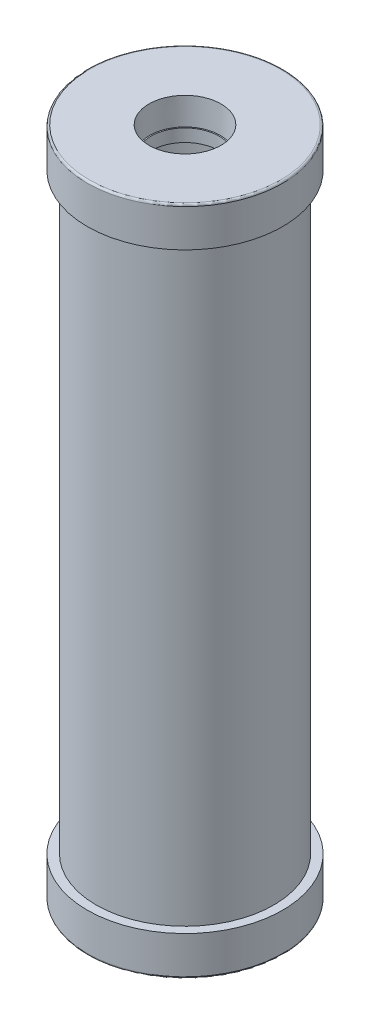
ISO-10303-21;
HEADER;
FILE_DESCRIPTION(('STEP AP214'),'2;1');
FILE_NAME('part.step','',(''),(''),'','','');
FILE_SCHEMA(('AUTOMOTIVE_DESIGN { 1 0 10303 214 1 1 1 1 }'));
ENDSEC;
DATA;
#1=APPLICATION_CONTEXT('core data for automotive mechanical design processes');
#2=APPLICATION_PROTOCOL_DEFINITION('international standard','automotive_design',2000,#1);
#3=PRODUCT_CONTEXT('',#1,'mechanical');
#4=PRODUCT('Part','Part','',(#3));
#5=PRODUCT_RELATED_PRODUCT_CATEGORY('part','',(#4));
#6=PRODUCT_DEFINITION_FORMATION('','',#4);
#7=PRODUCT_DEFINITION_CONTEXT('part definition',#1,'design');
#8=PRODUCT_DEFINITION('design','',#6,#7);
#9=PRODUCT_DEFINITION_SHAPE('','',#8);
#10=(LENGTH_UNIT() NAMED_UNIT(*) SI_UNIT(.MILLI.,.METRE.));
#11=(NAMED_UNIT(*) PLANE_ANGLE_UNIT() SI_UNIT($,.RADIAN.));
#12=(NAMED_UNIT(*) SI_UNIT($,.STERADIAN.) SOLID_ANGLE_UNIT());
#13=UNCERTAINTY_MEASURE_WITH_UNIT(LENGTH_MEASURE(1.E-05),#10,'distance_accuracy_value','');
#14=(GEOMETRIC_REPRESENTATION_CONTEXT(3) GLOBAL_UNCERTAINTY_ASSIGNED_CONTEXT((#13)) GLOBAL_UNIT_ASSIGNED_CONTEXT((#10,
#11,#12)) REPRESENTATION_CONTEXT('',''));
#15=CARTESIAN_POINT('',(0.,0.,0.));
#16=DIRECTION('',(0.,0.,1.));
#17=DIRECTION('',(1.,0.,0.));
#18=AXIS2_PLACEMENT_3D('',#15,#16,#17);
#19=CARTESIAN_POINT('',(0.,431.8,0.));
#20=DIRECTION('',(0.,-1.,0.));
#21=DIRECTION('',(0.,0.,-1.));
#22=AXIS2_PLACEMENT_3D('',#19,#20,#21);
#23=CYLINDRICAL_SURFACE('',#22,57.15);
#24=CARTESIAN_POINT('',(0.,25.4,0.));
#25=DIRECTION('',(0.,1.,0.));
#26=DIRECTION('',(0.,0.,1.));
#27=AXIS2_PLACEMENT_3D('',#24,#25,#26);
#28=CIRCLE('',#27,57.15);
#29=CARTESIAN_POINT('',(0.,25.4,57.15));
#30=VERTEX_POINT('',#29);
#31=EDGE_CURVE('E71',#30,#30,#28,.T.);
#32=ORIENTED_EDGE('',*,*,#31,.T.);
#33=EDGE_LOOP('',(#32));
#34=FACE_BOUND('',#33,.T.);
#35=CARTESIAN_POINT('',(0.,406.4,0.));
#36=DIRECTION('',(0.,1.,0.));
#37=DIRECTION('',(0.,0.,1.));
#38=AXIS2_PLACEMENT_3D('',#35,#36,#37);
#39=CIRCLE('',#38,57.15);
#40=CARTESIAN_POINT('',(0.,406.4,57.15));
#41=VERTEX_POINT('',#40);
#42=EDGE_CURVE('E53',#41,#41,#39,.T.);
#43=ORIENTED_EDGE('',*,*,#42,.F.);
#44=EDGE_LOOP('',(#43));
#45=FACE_BOUND('',#44,.T.);
#46=ADVANCED_FACE('F33',(#34,#45),#23,.T.);
#47=CARTESIAN_POINT('',(0.,431.8,0.));
#48=DIRECTION('',(0.,-1.,0.));
#49=DIRECTION('',(0.,0.,-1.));
#50=AXIS2_PLACEMENT_3D('',#47,#48,#49);
#51=CYLINDRICAL_SURFACE('',#50,50.546);
#52=CARTESIAN_POINT('',(0.,25.4,0.));
#53=DIRECTION('',(0.,1.,0.));
#54=DIRECTION('',(0.,0.,1.));
#55=AXIS2_PLACEMENT_3D('',#52,#53,#54);
#56=CIRCLE('',#55,50.546);
#57=CARTESIAN_POINT('',(0.,25.4,50.546));
#58=VERTEX_POINT('',#57);
#59=EDGE_CURVE('E68',#58,#58,#56,.T.);
#60=ORIENTED_EDGE('',*,*,#59,.F.);
#61=EDGE_LOOP('',(#60));
#62=FACE_BOUND('',#61,.T.);
#63=CARTESIAN_POINT('',(0.,406.4,0.));
#64=DIRECTION('',(0.,1.,0.));
#65=DIRECTION('',(0.,0.,1.));
#66=AXIS2_PLACEMENT_3D('',#63,#64,#65);
#67=CIRCLE('',#66,50.546);
#68=CARTESIAN_POINT('',(0.,406.4,50.546));
#69=VERTEX_POINT('',#68);
#70=EDGE_CURVE('E59',#69,#69,#67,.T.);
#71=ORIENTED_EDGE('',*,*,#70,.T.);
#72=EDGE_LOOP('',(#71));
#73=FACE_BOUND('',#72,.T.);
#74=ADVANCED_FACE('F116',(#62,#73),#51,.F.);
#75=CARTESIAN_POINT('',(0.,25.4,0.));
#76=DIRECTION('',(0.,1.,0.));
#77=DIRECTION('',(0.,0.,1.));
#78=AXIS2_PLACEMENT_3D('',#75,#76,#77);
#79=PLANE('',#78);
#80=CARTESIAN_POINT('',(0.,25.4,0.));
#81=DIRECTION('',(0.,1.,0.));
#82=DIRECTION('',(0.,0.,1.));
#83=AXIS2_PLACEMENT_3D('',#80,#81,#82);
#84=CIRCLE('',#83,21.8313);
#85=CARTESIAN_POINT('',(0.,25.4,21.8313));
#86=VERTEX_POINT('',#85);
#87=EDGE_CURVE('E63',#86,#86,#84,.T.);
#88=ORIENTED_EDGE('',*,*,#87,.F.);
#89=EDGE_LOOP('',(#88));
#90=FACE_BOUND('',#89,.T.);
#91=ORIENTED_EDGE('',*,*,#59,.T.);
#92=EDGE_LOOP('',(#91));
#93=FACE_BOUND('',#92,.T.);
#94=ADVANCED_FACE('F123',(#90,#93),#79,.T.);
#95=CARTESIAN_POINT('',(0.,25.4,0.));
#96=DIRECTION('',(0.,1.,0.));
#97=DIRECTION('',(0.,0.,1.));
#98=AXIS2_PLACEMENT_3D('',#95,#96,#97);
#99=CIRCLE('',#98,62.865);
#100=CARTESIAN_POINT('',(0.,25.4,62.865));
#101=VERTEX_POINT('',#100);
#102=EDGE_CURVE('E66',#101,#101,#99,.T.);
#103=ORIENTED_EDGE('',*,*,#102,.T.);
#104=EDGE_LOOP('',(#103));
#105=FACE_BOUND('',#104,.T.);
#106=ORIENTED_EDGE('',*,*,#31,.F.);
#107=EDGE_LOOP('',(#106));
#108=FACE_BOUND('',#107,.T.);
#109=ADVANCED_FACE('F143',(#105,#108),#79,.T.);
#110=CARTESIAN_POINT('',(0.,25.4,0.));
#111=DIRECTION('',(0.,-1.,0.));
#112=DIRECTION('',(0.,0.,-1.));
#113=AXIS2_PLACEMENT_3D('',#110,#111,#112);
#114=CYLINDRICAL_SURFACE('',#113,62.865);
#115=CARTESIAN_POINT('',(0.,1.27,0.));
#116=DIRECTION('',(0.,1.,0.));
#117=DIRECTION('',(0.,0.,1.));
#118=AXIS2_PLACEMENT_3D('',#115,#116,#117);
#119=CIRCLE('',#118,62.865);
#120=CARTESIAN_POINT('',(0.,1.27,62.865));
#121=VERTEX_POINT('',#120);
#122=EDGE_CURVE('E48',#121,#121,#119,.T.);
#123=ORIENTED_EDGE('',*,*,#122,.T.);
#124=EDGE_LOOP('',(#123));
#125=FACE_BOUND('',#124,.T.);
#126=ORIENTED_EDGE('',*,*,#102,.F.);
#127=EDGE_LOOP('',(#126));
#128=FACE_BOUND('',#127,.T.);
#129=ADVANCED_FACE('F140',(#125,#128),#114,.T.);
#130=CARTESIAN_POINT('',(0.,0.,0.));
#131=DIRECTION('',(0.,1.,0.));
#132=DIRECTION('',(0.,0.,1.));
#133=AXIS2_PLACEMENT_3D('',#130,#131,#132);
#134=PLANE('',#133);
#135=CARTESIAN_POINT('',(0.,0.,0.));
#136=DIRECTION('',(0.,1.,0.));
#137=DIRECTION('',(0.,0.,1.));
#138=AXIS2_PLACEMENT_3D('',#135,#136,#137);
#139=CIRCLE('',#138,61.595);
#140=CARTESIAN_POINT('',(0.,0.,61.595));
#141=VERTEX_POINT('',#140);
#142=EDGE_CURVE('E44',#141,#141,#139,.F.);
#143=ORIENTED_EDGE('',*,*,#142,.T.);
#144=EDGE_LOOP('',(#143));
#145=FACE_BOUND('',#144,.T.);
#146=CARTESIAN_POINT('',(0.,0.,0.));
#147=DIRECTION('',(0.,-1.,0.));
#148=DIRECTION('',(0.,0.,-1.));
#149=AXIS2_PLACEMENT_3D('',#146,#147,#148);
#150=CIRCLE('',#149,23.1430322);
#151=CARTESIAN_POINT('',(0.,0.,-23.1430322));
#152=VERTEX_POINT('',#151);
#153=EDGE_CURVE('E62',#152,#152,#150,.T.);
#154=ORIENTED_EDGE('',*,*,#153,.F.);
#155=EDGE_LOOP('',(#154));
#156=FACE_BOUND('',#155,.T.);
#157=ADVANCED_FACE('F126',(#145,#156),#134,.F.);
#158=CARTESIAN_POINT('',(0.,0.,0.));
#159=DIRECTION('',(0.,-1.,0.));
#160=DIRECTION('',(0.,0.,-1.));
#161=AXIS2_PLACEMENT_3D('',#158,#159,#160);
#162=CYLINDRICAL_SURFACE('',#161,21.8313);
#163=ORIENTED_EDGE('',*,*,#87,.T.);
#164=EDGE_LOOP('',(#163));
#165=FACE_BOUND('',#164,.T.);
#166=CARTESIAN_POINT('',(0.,17.272,0.));
#167=DIRECTION('',(0.,-1.,0.));
#168=DIRECTION('',(0.,0.,-1.));
#169=AXIS2_PLACEMENT_3D('',#166,#167,#168);
#170=CIRCLE('',#169,21.8313);
#171=CARTESIAN_POINT('',(0.,17.272,-21.8313));
#172=VERTEX_POINT('',#171);
#173=EDGE_CURVE('E67',#172,#172,#170,.T.);
#174=ORIENTED_EDGE('',*,*,#173,.T.);
#175=EDGE_LOOP('',(#174));
#176=FACE_BOUND('',#175,.T.);
#177=ADVANCED_FACE('F157',(#165,#176),#162,.F.);
#178=CARTESIAN_POINT('',(21.8313,17.272,0.));
#179=DIRECTION('',(0.,1.,0.));
#180=DIRECTION('',(0.,0.,1.));
#181=AXIS2_PLACEMENT_3D('',#178,#179,#180);
#182=PLANE('',#181);
#183=ORIENTED_EDGE('',*,*,#173,.F.);
#184=EDGE_LOOP('',(#183));
#185=FACE_BOUND('',#184,.T.);
#186=CARTESIAN_POINT('',(0.,17.272,0.));
#187=DIRECTION('',(0.,-1.,0.));
#188=DIRECTION('',(0.,0.,-1.));
#189=AXIS2_PLACEMENT_3D('',#186,#187,#188);
#190=CIRCLE('',#189,22.6258853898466);
#191=CARTESIAN_POINT('',(0.,17.272,-22.6258853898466));
#192=VERTEX_POINT('',#191);
#193=EDGE_CURVE('E78',#192,#192,#190,.T.);
#194=ORIENTED_EDGE('',*,*,#193,.T.);
#195=EDGE_LOOP('',(#194));
#196=FACE_BOUND('',#195,.T.);
#197=ADVANCED_FACE('F160',(#185,#196),#182,.F.);
#198=CARTESIAN_POINT('',(0.,0.,0.));
#199=DIRECTION('',(0.,-1.,0.));
#200=DIRECTION('',(0.,0.,-1.));
#201=AXIS2_PLACEMENT_3D('',#198,#199,#200);
#202=CONICAL_SURFACE('',#201,23.1430322,0.0299323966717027);
#203=ORIENTED_EDGE('',*,*,#193,.F.);
#204=EDGE_LOOP('',(#203));
#205=FACE_BOUND('',#204,.T.);
#206=ORIENTED_EDGE('',*,*,#153,.T.);
#207=EDGE_LOOP('',(#206));
#208=FACE_BOUND('',#207,.T.);
#209=ADVANCED_FACE('F164',(#205,#208),#202,.F.);
#210=CARTESIAN_POINT('',(0.,406.4,0.));
#211=DIRECTION('',(0.,1.,0.));
#212=DIRECTION('',(0.,0.,1.));
#213=AXIS2_PLACEMENT_3D('',#210,#211,#212);
#214=PLANE('',#213);
#215=CARTESIAN_POINT('',(0.,406.4,0.));
#216=DIRECTION('',(0.,1.,0.));
#217=DIRECTION('',(0.,0.,1.));
#218=AXIS2_PLACEMENT_3D('',#215,#216,#217);
#219=CIRCLE('',#218,21.8313);
#220=CARTESIAN_POINT('',(0.,406.4,21.8313));
#221=VERTEX_POINT('',#220);
#222=EDGE_CURVE('E54',#221,#221,#219,.T.);
#223=ORIENTED_EDGE('',*,*,#222,.T.);
#224=EDGE_LOOP('',(#223));
#225=FACE_BOUND('',#224,.T.);
#226=ORIENTED_EDGE('',*,*,#70,.F.);
#227=EDGE_LOOP('',(#226));
#228=FACE_BOUND('',#227,.T.);
#229=ADVANCED_FACE('F167',(#225,#228),#214,.F.);
#230=CARTESIAN_POINT('',(0.,406.4,0.));
#231=DIRECTION('',(0.,1.,0.));
#232=DIRECTION('',(0.,0.,1.));
#233=AXIS2_PLACEMENT_3D('',#230,#231,#232);
#234=CIRCLE('',#233,62.865);
#235=CARTESIAN_POINT('',(0.,406.4,62.865));
#236=VERTEX_POINT('',#235);
#237=EDGE_CURVE('E57',#236,#236,#234,.T.);
#238=ORIENTED_EDGE('',*,*,#237,.F.);
#239=EDGE_LOOP('',(#238));
#240=FACE_BOUND('',#239,.T.);
#241=ORIENTED_EDGE('',*,*,#42,.T.);
#242=EDGE_LOOP('',(#241));
#243=FACE_BOUND('',#242,.T.);
#244=ADVANCED_FACE('F111',(#240,#243),#214,.F.);
#245=CARTESIAN_POINT('',(0.,406.4,0.));
#246=DIRECTION('',(0.,1.,0.));
#247=DIRECTION('',(0.,0.,1.));
#248=AXIS2_PLACEMENT_3D('',#245,#246,#247);
#249=CYLINDRICAL_SURFACE('',#248,62.865);
#250=CARTESIAN_POINT('',(0.,430.53,0.));
#251=DIRECTION('',(0.,1.,0.));
#252=DIRECTION('',(0.,0.,1.));
#253=AXIS2_PLACEMENT_3D('',#250,#251,#252);
#254=CIRCLE('',#253,62.865);
#255=CARTESIAN_POINT('',(0.,430.53,62.865));
#256=VERTEX_POINT('',#255);
#257=EDGE_CURVE('E10',#256,#256,#254,.F.);
#258=ORIENTED_EDGE('',*,*,#257,.T.);
#259=EDGE_LOOP('',(#258));
#260=FACE_BOUND('',#259,.T.);
#261=ORIENTED_EDGE('',*,*,#237,.T.);
#262=EDGE_LOOP('',(#261));
#263=FACE_BOUND('',#262,.T.);
#264=ADVANCED_FACE('F101',(#260,#263),#249,.T.);
#265=CARTESIAN_POINT('',(0.,431.8,0.));
#266=DIRECTION('',(0.,1.,0.));
#267=DIRECTION('',(0.,0.,1.));
#268=AXIS2_PLACEMENT_3D('',#265,#266,#267);
#269=PLANE('',#268);
#270=CARTESIAN_POINT('',(0.,431.8,0.));
#271=DIRECTION('',(0.,1.,0.));
#272=DIRECTION('',(0.,0.,1.));
#273=AXIS2_PLACEMENT_3D('',#270,#271,#272);
#274=CIRCLE('',#273,61.595);
#275=CARTESIAN_POINT('',(0.,431.8,61.595));
#276=VERTEX_POINT('',#275);
#277=EDGE_CURVE('E40',#276,#276,#274,.T.);
#278=ORIENTED_EDGE('',*,*,#277,.T.);
#279=EDGE_LOOP('',(#278));
#280=FACE_BOUND('',#279,.T.);
#281=CARTESIAN_POINT('',(0.,431.8,0.));
#282=DIRECTION('',(0.,1.,0.));
#283=DIRECTION('',(0.,0.,1.));
#284=AXIS2_PLACEMENT_3D('',#281,#282,#283);
#285=CIRCLE('',#284,23.1430322);
#286=CARTESIAN_POINT('',(0.,431.8,23.1430322));
#287=VERTEX_POINT('',#286);
#288=EDGE_CURVE('E92',#287,#287,#285,.T.);
#289=ORIENTED_EDGE('',*,*,#288,.F.);
#290=EDGE_LOOP('',(#289));
#291=FACE_BOUND('',#290,.T.);
#292=ADVANCED_FACE('F98',(#280,#291),#269,.T.);
#293=CARTESIAN_POINT('',(0.,431.8,0.));
#294=DIRECTION('',(0.,1.,0.));
#295=DIRECTION('',(0.,0.,1.));
#296=AXIS2_PLACEMENT_3D('',#293,#294,#295);
#297=CYLINDRICAL_SURFACE('',#296,21.8313);
#298=CARTESIAN_POINT('',(0.,414.528,0.));
#299=DIRECTION('',(0.,1.,0.));
#300=DIRECTION('',(0.,0.,1.));
#301=AXIS2_PLACEMENT_3D('',#298,#299,#300);
#302=CIRCLE('',#301,21.8313);
#303=CARTESIAN_POINT('',(0.,414.528,21.8313));
#304=VERTEX_POINT('',#303);
#305=EDGE_CURVE('E58',#304,#304,#302,.T.);
#306=ORIENTED_EDGE('',*,*,#305,.T.);
#307=EDGE_LOOP('',(#306));
#308=FACE_BOUND('',#307,.T.);
#309=ORIENTED_EDGE('',*,*,#222,.F.);
#310=EDGE_LOOP('',(#309));
#311=FACE_BOUND('',#310,.T.);
#312=ADVANCED_FACE('F100',(#308,#311),#297,.F.);
#313=CARTESIAN_POINT('',(21.8313,414.528,0.));
#314=DIRECTION('',(0.,-1.,0.));
#315=DIRECTION('',(0.,0.,-1.));
#316=AXIS2_PLACEMENT_3D('',#313,#314,#315);
#317=PLANE('',#316);
#318=ORIENTED_EDGE('',*,*,#305,.F.);
#319=EDGE_LOOP('',(#318));
#320=FACE_BOUND('',#319,.T.);
#321=CARTESIAN_POINT('',(0.,414.528,0.));
#322=DIRECTION('',(0.,1.,0.));
#323=DIRECTION('',(0.,0.,1.));
#324=AXIS2_PLACEMENT_3D('',#321,#322,#323);
#325=CIRCLE('',#324,22.6258853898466);
#326=CARTESIAN_POINT('',(0.,414.528,22.6258853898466));
#327=VERTEX_POINT('',#326);
#328=EDGE_CURVE('E89',#327,#327,#325,.T.);
#329=ORIENTED_EDGE('',*,*,#328,.T.);
#330=EDGE_LOOP('',(#329));
#331=FACE_BOUND('',#330,.T.);
#332=ADVANCED_FACE('F108',(#320,#331),#317,.F.);
#333=CARTESIAN_POINT('',(0.,431.8,0.));
#334=DIRECTION('',(0.,1.,0.));
#335=DIRECTION('',(0.,0.,1.));
#336=AXIS2_PLACEMENT_3D('',#333,#334,#335);
#337=CONICAL_SURFACE('',#336,23.1430322,0.0299323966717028);
#338=ORIENTED_EDGE('',*,*,#328,.F.);
#339=EDGE_LOOP('',(#338));
#340=FACE_BOUND('',#339,.T.);
#341=ORIENTED_EDGE('',*,*,#288,.T.);
#342=EDGE_LOOP('',(#341));
#343=FACE_BOUND('',#342,.T.);
#344=ADVANCED_FACE('F96',(#340,#343),#337,.F.);
#345=CARTESIAN_POINT('',(0.,1.27,0.));
#346=DIRECTION('',(0.,1.,0.));
#347=DIRECTION('',(0.,0.,1.));
#348=AXIS2_PLACEMENT_3D('',#345,#346,#347);
#349=TOROIDAL_SURFACE('',#348,61.595,1.27);
#350=ORIENTED_EDGE('',*,*,#142,.F.);
#351=EDGE_LOOP('',(#350));
#352=FACE_BOUND('',#351,.T.);
#353=ORIENTED_EDGE('',*,*,#122,.F.);
#354=EDGE_LOOP('',(#353));
#355=FACE_BOUND('',#354,.T.);
#356=ADVANCED_FACE('F127',(#352,#355),#349,.T.);
#357=CARTESIAN_POINT('',(0.,430.53,0.));
#358=DIRECTION('',(0.,1.,0.));
#359=DIRECTION('',(0.,0.,1.));
#360=AXIS2_PLACEMENT_3D('',#357,#358,#359);
#361=TOROIDAL_SURFACE('',#360,61.595,1.27);
#362=ORIENTED_EDGE('',*,*,#257,.F.);
#363=EDGE_LOOP('',(#362));
#364=FACE_BOUND('',#363,.T.);
#365=ORIENTED_EDGE('',*,*,#277,.F.);
#366=EDGE_LOOP('',(#365));
#367=FACE_BOUND('',#366,.T.);
#368=ADVANCED_FACE('F35',(#364,#367),#361,.T.);
#369=CLOSED_SHELL('',(#46,#74,#94,#109,#129,#157,#177,#197,#209,#229,#244,#264,#292,#312,#332,
#344,#356,#368));
#370=MANIFOLD_SOLID_BREP('B2',#369);
#371=ADVANCED_BREP_SHAPE_REPRESENTATION('',(#18,#370),#14);
#372=SHAPE_DEFINITION_REPRESENTATION(#9,#371);
ENDSEC;
END-ISO-10303-21;
